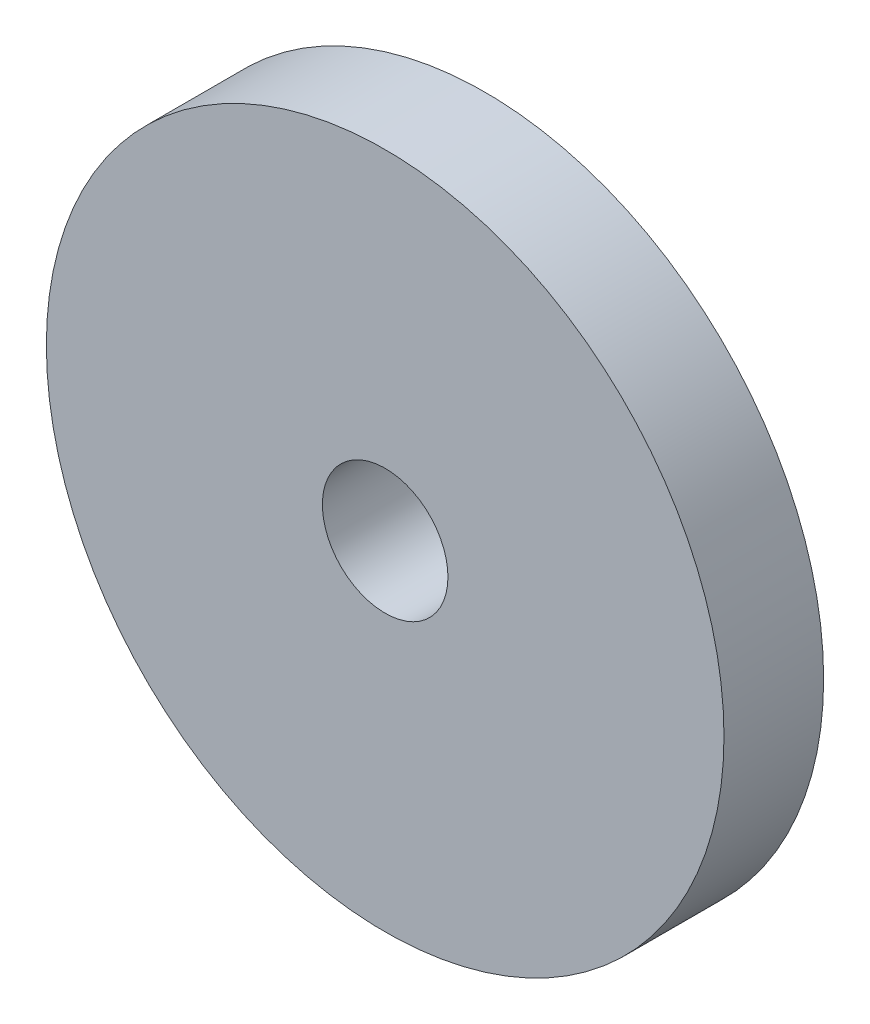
from build123d import *

# Parameters (mm, degrees)
ESQUISSE1_R      = 17
ESQUISSE1_R_2    = 3.15
EXTRUSION1_DEPTH = 5


with BuildPart() as part:
    # Esquisse1 → Extrusion1 (new body)
    with BuildSketch(Plane.XY):
        Circle(ESQUISSE1_R)
        Circle(ESQUISSE1_R_2, mode=Mode.SUBTRACT)
    extrude(amount=EXTRUSION1_DEPTH)


solid = part.part
